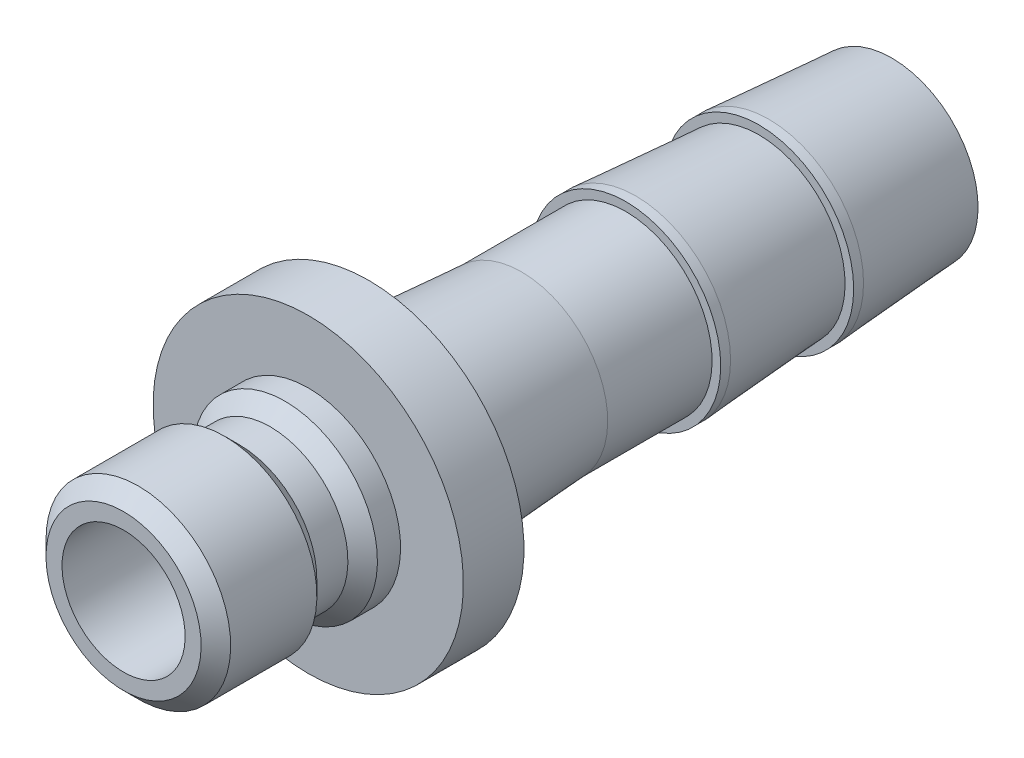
ISO-10303-21;
HEADER;
FILE_DESCRIPTION(('STEP AP214'),'2;1');
FILE_NAME('part.step','',(''),(''),'','','');
FILE_SCHEMA(('AUTOMOTIVE_DESIGN { 1 0 10303 214 1 1 1 1 }'));
ENDSEC;
DATA;
#1=APPLICATION_CONTEXT('core data for automotive mechanical design processes');
#2=APPLICATION_PROTOCOL_DEFINITION('international standard','automotive_design',2000,#1);
#3=PRODUCT_CONTEXT('',#1,'mechanical');
#4=PRODUCT('Part','Part','',(#3));
#5=PRODUCT_RELATED_PRODUCT_CATEGORY('part','',(#4));
#6=PRODUCT_DEFINITION_FORMATION('','',#4);
#7=PRODUCT_DEFINITION_CONTEXT('part definition',#1,'design');
#8=PRODUCT_DEFINITION('design','',#6,#7);
#9=PRODUCT_DEFINITION_SHAPE('','',#8);
#10=(LENGTH_UNIT() NAMED_UNIT(*) SI_UNIT(.MILLI.,.METRE.));
#11=(NAMED_UNIT(*) PLANE_ANGLE_UNIT() SI_UNIT($,.RADIAN.));
#12=(NAMED_UNIT(*) SI_UNIT($,.STERADIAN.) SOLID_ANGLE_UNIT());
#13=UNCERTAINTY_MEASURE_WITH_UNIT(LENGTH_MEASURE(1.E-05),#10,'distance_accuracy_value','');
#14=(GEOMETRIC_REPRESENTATION_CONTEXT(3) GLOBAL_UNCERTAINTY_ASSIGNED_CONTEXT((#13)) GLOBAL_UNIT_ASSIGNED_CONTEXT((#10,
#11,#12)) REPRESENTATION_CONTEXT('',''));
#15=CARTESIAN_POINT('',(0.,0.,0.));
#16=DIRECTION('',(0.,0.,1.));
#17=DIRECTION('',(1.,0.,0.));
#18=AXIS2_PLACEMENT_3D('',#15,#16,#17);
#19=CARTESIAN_POINT('',(0.,0.,0.));
#20=DIRECTION('',(0.,0.,-1.));
#21=DIRECTION('',(0.,1.,0.));
#22=AXIS2_PLACEMENT_3D('',#19,#20,#21);
#23=CYLINDRICAL_SURFACE('',#22,3.175);
#24=CARTESIAN_POINT('',(0.,0.,-30.099));
#25=DIRECTION('',(0.,0.,-1.));
#26=DIRECTION('',(0.,1.,0.));
#27=AXIS2_PLACEMENT_3D('',#24,#25,#26);
#28=CIRCLE('',#27,3.17499999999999);
#29=CARTESIAN_POINT('',(0.,3.175,-30.099));
#30=VERTEX_POINT('',#29);
#31=EDGE_CURVE('E98',#30,#30,#28,.T.);
#32=ORIENTED_EDGE('',*,*,#31,.T.);
#33=EDGE_LOOP('',(#32));
#34=FACE_BOUND('',#33,.T.);
#35=CARTESIAN_POINT('',(0.,0.,9.525));
#36=DIRECTION('',(0.,0.,-1.));
#37=DIRECTION('',(0.,1.,0.));
#38=AXIS2_PLACEMENT_3D('',#35,#36,#37);
#39=CIRCLE('',#38,3.175);
#40=CARTESIAN_POINT('',(0.,3.175,9.525));
#41=VERTEX_POINT('',#40);
#42=EDGE_CURVE('E10',#41,#41,#39,.T.);
#43=ORIENTED_EDGE('',*,*,#42,.F.);
#44=EDGE_LOOP('',(#43));
#45=FACE_BOUND('',#44,.T.);
#46=ADVANCED_FACE('F31',(#34,#45),#23,.F.);
#47=CARTESIAN_POINT('',(0.,3.175,9.525));
#48=DIRECTION('',(0.,0.,1.));
#49=DIRECTION('',(0.,-1.,0.));
#50=AXIS2_PLACEMENT_3D('',#47,#48,#49);
#51=PLANE('',#50);
#52=ORIENTED_EDGE('',*,*,#42,.T.);
#53=EDGE_LOOP('',(#52));
#54=FACE_BOUND('',#53,.T.);
#55=CARTESIAN_POINT('',(0.,0.,9.525));
#56=DIRECTION('',(0.,0.,-1.));
#57=DIRECTION('',(0.,1.,0.));
#58=AXIS2_PLACEMENT_3D('',#55,#56,#57);
#59=CIRCLE('',#58,4.0005);
#60=CARTESIAN_POINT('',(0.,4.0005,9.525));
#61=VERTEX_POINT('',#60);
#62=EDGE_CURVE('E37',#61,#61,#59,.T.);
#63=ORIENTED_EDGE('',*,*,#62,.F.);
#64=EDGE_LOOP('',(#63));
#65=FACE_BOUND('',#64,.T.);
#66=ADVANCED_FACE('F116',(#54,#65),#51,.T.);
#67=CARTESIAN_POINT('',(0.,0.,8.763));
#68=DIRECTION('',(0.,0.,-1.));
#69=DIRECTION('',(0.,1.,0.));
#70=AXIS2_PLACEMENT_3D('',#67,#68,#69);
#71=CONICAL_SURFACE('',#70,4.7625,0.785398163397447);
#72=ORIENTED_EDGE('',*,*,#62,.T.);
#73=EDGE_LOOP('',(#72));
#74=FACE_BOUND('',#73,.T.);
#75=CARTESIAN_POINT('',(0.,0.,8.763));
#76=DIRECTION('',(0.,0.,-1.));
#77=DIRECTION('',(0.,1.,0.));
#78=AXIS2_PLACEMENT_3D('',#75,#76,#77);
#79=CIRCLE('',#78,4.7625);
#80=CARTESIAN_POINT('',(0.,4.7625,8.763));
#81=VERTEX_POINT('',#80);
#82=EDGE_CURVE('E41',#81,#81,#79,.T.);
#83=ORIENTED_EDGE('',*,*,#82,.F.);
#84=EDGE_LOOP('',(#83));
#85=FACE_BOUND('',#84,.T.);
#86=ADVANCED_FACE('F120',(#74,#85),#71,.T.);
#87=CARTESIAN_POINT('',(0.,0.,0.));
#88=DIRECTION('',(0.,0.,-1.));
#89=DIRECTION('',(0.,1.,0.));
#90=AXIS2_PLACEMENT_3D('',#87,#88,#89);
#91=CYLINDRICAL_SURFACE('',#90,4.7625);
#92=ORIENTED_EDGE('',*,*,#82,.T.);
#93=EDGE_LOOP('',(#92));
#94=FACE_BOUND('',#93,.T.);
#95=CARTESIAN_POINT('',(0.,0.,4.318));
#96=DIRECTION('',(0.,0.,-1.));
#97=DIRECTION('',(0.,1.,0.));
#98=AXIS2_PLACEMENT_3D('',#95,#96,#97);
#99=CIRCLE('',#98,4.7625);
#100=CARTESIAN_POINT('',(0.,4.7625,4.318));
#101=VERTEX_POINT('',#100);
#102=EDGE_CURVE('E45',#101,#101,#99,.T.);
#103=ORIENTED_EDGE('',*,*,#102,.F.);
#104=EDGE_LOOP('',(#103));
#105=FACE_BOUND('',#104,.T.);
#106=ADVANCED_FACE('F124',(#94,#105),#91,.T.);
#107=CARTESIAN_POINT('',(0.,0.,3.556));
#108=DIRECTION('',(0.,0.,1.));
#109=DIRECTION('',(0.,-1.,0.));
#110=AXIS2_PLACEMENT_3D('',#107,#108,#109);
#111=CONICAL_SURFACE('',#110,4.0005,0.785398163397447);
#112=ORIENTED_EDGE('',*,*,#102,.T.);
#113=EDGE_LOOP('',(#112));
#114=FACE_BOUND('',#113,.T.);
#115=CARTESIAN_POINT('',(0.,0.,3.556));
#116=DIRECTION('',(0.,0.,-1.));
#117=DIRECTION('',(0.,1.,0.));
#118=AXIS2_PLACEMENT_3D('',#115,#116,#117);
#119=CIRCLE('',#118,4.0005);
#120=CARTESIAN_POINT('',(0.,4.0005,3.556));
#121=VERTEX_POINT('',#120);
#122=EDGE_CURVE('E50',#121,#121,#119,.T.);
#123=ORIENTED_EDGE('',*,*,#122,.F.);
#124=EDGE_LOOP('',(#123));
#125=FACE_BOUND('',#124,.T.);
#126=ADVANCED_FACE('F130',(#114,#125),#111,.T.);
#127=CARTESIAN_POINT('',(0.,0.,0.));
#128=DIRECTION('',(0.,0.,-1.));
#129=DIRECTION('',(0.,1.,0.));
#130=AXIS2_PLACEMENT_3D('',#127,#128,#129);
#131=CYLINDRICAL_SURFACE('',#130,4.0005);
#132=ORIENTED_EDGE('',*,*,#122,.T.);
#133=EDGE_LOOP('',(#132));
#134=FACE_BOUND('',#133,.T.);
#135=CARTESIAN_POINT('',(0.,0.,1.9558));
#136=DIRECTION('',(0.,0.,-1.));
#137=DIRECTION('',(0.,1.,0.));
#138=AXIS2_PLACEMENT_3D('',#135,#136,#137);
#139=CIRCLE('',#138,4.0005);
#140=CARTESIAN_POINT('',(0.,4.0005,1.9558));
#141=VERTEX_POINT('',#140);
#142=EDGE_CURVE('E53',#141,#141,#139,.T.);
#143=ORIENTED_EDGE('',*,*,#142,.F.);
#144=EDGE_LOOP('',(#143));
#145=FACE_BOUND('',#144,.T.);
#146=ADVANCED_FACE('F134',(#134,#145),#131,.T.);
#147=CARTESIAN_POINT('',(0.,0.,1.1938));
#148=DIRECTION('',(0.,0.,-1.));
#149=DIRECTION('',(0.,1.,0.));
#150=AXIS2_PLACEMENT_3D('',#147,#148,#149);
#151=CONICAL_SURFACE('',#150,4.7625,0.785398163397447);
#152=ORIENTED_EDGE('',*,*,#142,.T.);
#153=EDGE_LOOP('',(#152));
#154=FACE_BOUND('',#153,.T.);
#155=CARTESIAN_POINT('',(0.,0.,1.1938));
#156=DIRECTION('',(0.,0.,-1.));
#157=DIRECTION('',(0.,1.,0.));
#158=AXIS2_PLACEMENT_3D('',#155,#156,#157);
#159=CIRCLE('',#158,4.7625);
#160=CARTESIAN_POINT('',(0.,4.7625,1.1938));
#161=VERTEX_POINT('',#160);
#162=EDGE_CURVE('E56',#161,#161,#159,.T.);
#163=ORIENTED_EDGE('',*,*,#162,.F.);
#164=EDGE_LOOP('',(#163));
#165=FACE_BOUND('',#164,.T.);
#166=ADVANCED_FACE('F138',(#154,#165),#151,.T.);
#167=CARTESIAN_POINT('',(0.,0.,0.));
#168=DIRECTION('',(0.,0.,-1.));
#169=DIRECTION('',(0.,1.,0.));
#170=AXIS2_PLACEMENT_3D('',#167,#168,#169);
#171=CYLINDRICAL_SURFACE('',#170,4.7625);
#172=ORIENTED_EDGE('',*,*,#162,.T.);
#173=EDGE_LOOP('',(#172));
#174=FACE_BOUND('',#173,.T.);
#175=CARTESIAN_POINT('',(0.,0.,0.));
#176=DIRECTION('',(0.,0.,-1.));
#177=DIRECTION('',(0.,1.,0.));
#178=AXIS2_PLACEMENT_3D('',#175,#176,#177);
#179=CIRCLE('',#178,4.7625);
#180=CARTESIAN_POINT('',(0.,4.7625,0.));
#181=VERTEX_POINT('',#180);
#182=EDGE_CURVE('E59',#181,#181,#179,.T.);
#183=ORIENTED_EDGE('',*,*,#182,.F.);
#184=EDGE_LOOP('',(#183));
#185=FACE_BOUND('',#184,.T.);
#186=ADVANCED_FACE('F142',(#174,#185),#171,.T.);
#187=CARTESIAN_POINT('',(0.,4.7625,0.));
#188=DIRECTION('',(0.,0.,1.));
#189=DIRECTION('',(0.,-1.,0.));
#190=AXIS2_PLACEMENT_3D('',#187,#188,#189);
#191=PLANE('',#190);
#192=ORIENTED_EDGE('',*,*,#182,.T.);
#193=EDGE_LOOP('',(#192));
#194=FACE_BOUND('',#193,.T.);
#195=CARTESIAN_POINT('',(0.,0.,0.));
#196=DIRECTION('',(0.,0.,-1.));
#197=DIRECTION('',(0.,1.,0.));
#198=AXIS2_PLACEMENT_3D('',#195,#196,#197);
#199=CIRCLE('',#198,8.001);
#200=CARTESIAN_POINT('',(0.,8.001,0.));
#201=VERTEX_POINT('',#200);
#202=EDGE_CURVE('E62',#201,#201,#199,.T.);
#203=ORIENTED_EDGE('',*,*,#202,.F.);
#204=EDGE_LOOP('',(#203));
#205=FACE_BOUND('',#204,.T.);
#206=ADVANCED_FACE('F146',(#194,#205),#191,.T.);
#207=CARTESIAN_POINT('',(0.,0.,0.));
#208=DIRECTION('',(0.,0.,-1.));
#209=DIRECTION('',(0.,1.,0.));
#210=AXIS2_PLACEMENT_3D('',#207,#208,#209);
#211=CYLINDRICAL_SURFACE('',#210,8.001);
#212=ORIENTED_EDGE('',*,*,#202,.T.);
#213=EDGE_LOOP('',(#212));
#214=FACE_BOUND('',#213,.T.);
#215=CARTESIAN_POINT('',(0.,0.,-3.1242));
#216=DIRECTION('',(0.,0.,-1.));
#217=DIRECTION('',(0.,1.,0.));
#218=AXIS2_PLACEMENT_3D('',#215,#216,#217);
#219=CIRCLE('',#218,8.001);
#220=CARTESIAN_POINT('',(0.,8.001,-3.1242));
#221=VERTEX_POINT('',#220);
#222=EDGE_CURVE('E65',#221,#221,#219,.T.);
#223=ORIENTED_EDGE('',*,*,#222,.F.);
#224=EDGE_LOOP('',(#223));
#225=FACE_BOUND('',#224,.T.);
#226=ADVANCED_FACE('F150',(#214,#225),#211,.T.);
#227=CARTESIAN_POINT('',(0.,8.001,-3.1242));
#228=DIRECTION('',(0.,0.,-1.));
#229=DIRECTION('',(0.,1.,0.));
#230=AXIS2_PLACEMENT_3D('',#227,#228,#229);
#231=PLANE('',#230);
#232=ORIENTED_EDGE('',*,*,#222,.T.);
#233=EDGE_LOOP('',(#232));
#234=FACE_BOUND('',#233,.T.);
#235=CARTESIAN_POINT('',(0.,0.,-3.1242));
#236=DIRECTION('',(0.,0.,-1.));
#237=DIRECTION('',(0.,1.,0.));
#238=AXIS2_PLACEMENT_3D('',#235,#236,#237);
#239=CIRCLE('',#238,4.8895);
#240=CARTESIAN_POINT('',(0.,4.8895,-3.1242));
#241=VERTEX_POINT('',#240);
#242=EDGE_CURVE('E68',#241,#241,#239,.T.);
#243=ORIENTED_EDGE('',*,*,#242,.F.);
#244=EDGE_LOOP('',(#243));
#245=FACE_BOUND('',#244,.T.);
#246=ADVANCED_FACE('F154',(#234,#245),#231,.T.);
#247=CARTESIAN_POINT('',(0.,0.,0.));
#248=DIRECTION('',(0.,0.,-1.));
#249=DIRECTION('',(0.,1.,0.));
#250=AXIS2_PLACEMENT_3D('',#247,#248,#249);
#251=CYLINDRICAL_SURFACE('',#250,4.8895);
#252=ORIENTED_EDGE('',*,*,#242,.T.);
#253=EDGE_LOOP('',(#252));
#254=FACE_BOUND('',#253,.T.);
#255=CARTESIAN_POINT('',(0.,0.,-4.6482));
#256=DIRECTION('',(0.,0.,-1.));
#257=DIRECTION('',(0.,1.,0.));
#258=AXIS2_PLACEMENT_3D('',#255,#256,#257);
#259=CIRCLE('',#258,4.8895);
#260=CARTESIAN_POINT('',(0.,4.8895,-4.6482));
#261=VERTEX_POINT('',#260);
#262=EDGE_CURVE('E71',#261,#261,#259,.T.);
#263=ORIENTED_EDGE('',*,*,#262,.F.);
#264=EDGE_LOOP('',(#263));
#265=FACE_BOUND('',#264,.T.);
#266=ADVANCED_FACE('F158',(#254,#265),#251,.T.);
#267=CARTESIAN_POINT('',(0.,0.,-10.9982));
#268=DIRECTION('',(0.,0.,1.));
#269=DIRECTION('',(0.,-1.,0.));
#270=AXIS2_PLACEMENT_3D('',#267,#268,#269);
#271=CONICAL_SURFACE('',#270,4.445,0.0698860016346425);
#272=ORIENTED_EDGE('',*,*,#262,.T.);
#273=EDGE_LOOP('',(#272));
#274=FACE_BOUND('',#273,.T.);
#275=CARTESIAN_POINT('',(0.,0.,-10.9982));
#276=DIRECTION('',(0.,0.,-1.));
#277=DIRECTION('',(0.,1.,0.));
#278=AXIS2_PLACEMENT_3D('',#275,#276,#277);
#279=CIRCLE('',#278,4.445);
#280=CARTESIAN_POINT('',(0.,4.445,-10.9982));
#281=VERTEX_POINT('',#280);
#282=EDGE_CURVE('E74',#281,#281,#279,.T.);
#283=ORIENTED_EDGE('',*,*,#282,.F.);
#284=EDGE_LOOP('',(#283));
#285=FACE_BOUND('',#284,.T.);
#286=ADVANCED_FACE('F162',(#274,#285),#271,.T.);
#287=CARTESIAN_POINT('',(0.,0.,0.));
#288=DIRECTION('',(0.,0.,-1.));
#289=DIRECTION('',(0.,1.,0.));
#290=AXIS2_PLACEMENT_3D('',#287,#288,#289);
#291=CYLINDRICAL_SURFACE('',#290,4.445);
#292=ORIENTED_EDGE('',*,*,#282,.T.);
#293=EDGE_LOOP('',(#292));
#294=FACE_BOUND('',#293,.T.);
#295=CARTESIAN_POINT('',(0.,0.,-16.383));
#296=DIRECTION('',(0.,0.,-1.));
#297=DIRECTION('',(0.,1.,0.));
#298=AXIS2_PLACEMENT_3D('',#295,#296,#297);
#299=CIRCLE('',#298,4.44499999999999);
#300=CARTESIAN_POINT('',(0.,4.445,-16.383));
#301=VERTEX_POINT('',#300);
#302=EDGE_CURVE('E77',#301,#301,#299,.T.);
#303=ORIENTED_EDGE('',*,*,#302,.F.);
#304=EDGE_LOOP('',(#303));
#305=FACE_BOUND('',#304,.T.);
#306=ADVANCED_FACE('F166',(#294,#305),#291,.T.);
#307=CARTESIAN_POINT('',(0.,4.8895,-16.383));
#308=DIRECTION('',(0.,0.,1.));
#309=DIRECTION('',(0.,-1.,0.));
#310=AXIS2_PLACEMENT_3D('',#307,#308,#309);
#311=PLANE('',#310);
#312=ORIENTED_EDGE('',*,*,#302,.T.);
#313=EDGE_LOOP('',(#312));
#314=FACE_BOUND('',#313,.T.);
#315=CARTESIAN_POINT('',(0.,0.,-16.383));
#316=DIRECTION('',(0.,0.,-1.));
#317=DIRECTION('',(0.,1.,0.));
#318=AXIS2_PLACEMENT_3D('',#315,#316,#317);
#319=CIRCLE('',#318,4.8895);
#320=CARTESIAN_POINT('',(0.,4.8895,-16.383));
#321=VERTEX_POINT('',#320);
#322=EDGE_CURVE('E80',#321,#321,#319,.T.);
#323=ORIENTED_EDGE('',*,*,#322,.F.);
#324=EDGE_LOOP('',(#323));
#325=FACE_BOUND('',#324,.T.);
#326=ADVANCED_FACE('F170',(#314,#325),#311,.T.);
#327=CARTESIAN_POINT('',(0.,0.,0.));
#328=DIRECTION('',(0.,0.,-1.));
#329=DIRECTION('',(0.,1.,0.));
#330=AXIS2_PLACEMENT_3D('',#327,#328,#329);
#331=CYLINDRICAL_SURFACE('',#330,4.8895);
#332=ORIENTED_EDGE('',*,*,#322,.T.);
#333=EDGE_LOOP('',(#332));
#334=FACE_BOUND('',#333,.T.);
#335=CARTESIAN_POINT('',(0.,0.,-16.891));
#336=DIRECTION('',(0.,0.,-1.));
#337=DIRECTION('',(0.,1.,0.));
#338=AXIS2_PLACEMENT_3D('',#335,#336,#337);
#339=CIRCLE('',#338,4.8895);
#340=CARTESIAN_POINT('',(0.,4.8895,-16.891));
#341=VERTEX_POINT('',#340);
#342=EDGE_CURVE('E83',#341,#341,#339,.T.);
#343=ORIENTED_EDGE('',*,*,#342,.F.);
#344=EDGE_LOOP('',(#343));
#345=FACE_BOUND('',#344,.T.);
#346=ADVANCED_FACE('F174',(#334,#345),#331,.T.);
#347=CARTESIAN_POINT('',(0.,0.,-23.241));
#348=DIRECTION('',(0.,0.,1.));
#349=DIRECTION('',(0.,-1.,0.));
#350=AXIS2_PLACEMENT_3D('',#347,#348,#349);
#351=CONICAL_SURFACE('',#350,4.445,0.0698860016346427);
#352=ORIENTED_EDGE('',*,*,#342,.T.);
#353=EDGE_LOOP('',(#352));
#354=FACE_BOUND('',#353,.T.);
#355=CARTESIAN_POINT('',(0.,0.,-23.241));
#356=DIRECTION('',(0.,0.,-1.));
#357=DIRECTION('',(0.,1.,0.));
#358=AXIS2_PLACEMENT_3D('',#355,#356,#357);
#359=CIRCLE('',#358,4.445);
#360=CARTESIAN_POINT('',(0.,4.445,-23.241));
#361=VERTEX_POINT('',#360);
#362=EDGE_CURVE('E86',#361,#361,#359,.T.);
#363=ORIENTED_EDGE('',*,*,#362,.F.);
#364=EDGE_LOOP('',(#363));
#365=FACE_BOUND('',#364,.T.);
#366=ADVANCED_FACE('F178',(#354,#365),#351,.T.);
#367=CARTESIAN_POINT('',(0.,4.8895,-23.241));
#368=DIRECTION('',(0.,0.,1.));
#369=DIRECTION('',(0.,-1.,0.));
#370=AXIS2_PLACEMENT_3D('',#367,#368,#369);
#371=PLANE('',#370);
#372=ORIENTED_EDGE('',*,*,#362,.T.);
#373=EDGE_LOOP('',(#372));
#374=FACE_BOUND('',#373,.T.);
#375=CARTESIAN_POINT('',(0.,0.,-23.241));
#376=DIRECTION('',(0.,0.,-1.));
#377=DIRECTION('',(0.,1.,0.));
#378=AXIS2_PLACEMENT_3D('',#375,#376,#377);
#379=CIRCLE('',#378,4.8895);
#380=CARTESIAN_POINT('',(0.,4.8895,-23.241));
#381=VERTEX_POINT('',#380);
#382=EDGE_CURVE('E89',#381,#381,#379,.T.);
#383=ORIENTED_EDGE('',*,*,#382,.F.);
#384=EDGE_LOOP('',(#383));
#385=FACE_BOUND('',#384,.T.);
#386=ADVANCED_FACE('F182',(#374,#385),#371,.T.);
#387=CARTESIAN_POINT('',(0.,0.,0.));
#388=DIRECTION('',(0.,0.,-1.));
#389=DIRECTION('',(0.,1.,0.));
#390=AXIS2_PLACEMENT_3D('',#387,#388,#389);
#391=CYLINDRICAL_SURFACE('',#390,4.8895);
#392=ORIENTED_EDGE('',*,*,#382,.T.);
#393=EDGE_LOOP('',(#392));
#394=FACE_BOUND('',#393,.T.);
#395=CARTESIAN_POINT('',(0.,0.,-23.749));
#396=DIRECTION('',(0.,0.,-1.));
#397=DIRECTION('',(0.,1.,0.));
#398=AXIS2_PLACEMENT_3D('',#395,#396,#397);
#399=CIRCLE('',#398,4.8895);
#400=CARTESIAN_POINT('',(0.,4.8895,-23.749));
#401=VERTEX_POINT('',#400);
#402=EDGE_CURVE('E92',#401,#401,#399,.T.);
#403=ORIENTED_EDGE('',*,*,#402,.F.);
#404=EDGE_LOOP('',(#403));
#405=FACE_BOUND('',#404,.T.);
#406=ADVANCED_FACE('F112',(#394,#405),#391,.T.);
#407=CARTESIAN_POINT('',(0.,0.,-30.099));
#408=DIRECTION('',(0.,0.,1.));
#409=DIRECTION('',(0.,-1.,0.));
#410=AXIS2_PLACEMENT_3D('',#407,#408,#409);
#411=CONICAL_SURFACE('',#410,4.44499999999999,0.0698860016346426);
#412=ORIENTED_EDGE('',*,*,#402,.T.);
#413=EDGE_LOOP('',(#412));
#414=FACE_BOUND('',#413,.T.);
#415=CARTESIAN_POINT('',(0.,0.,-30.099));
#416=DIRECTION('',(0.,0.,-1.));
#417=DIRECTION('',(0.,1.,0.));
#418=AXIS2_PLACEMENT_3D('',#415,#416,#417);
#419=CIRCLE('',#418,4.44499999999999);
#420=CARTESIAN_POINT('',(0.,4.445,-30.099));
#421=VERTEX_POINT('',#420);
#422=EDGE_CURVE('E95',#421,#421,#419,.T.);
#423=ORIENTED_EDGE('',*,*,#422,.F.);
#424=EDGE_LOOP('',(#423));
#425=FACE_BOUND('',#424,.T.);
#426=ADVANCED_FACE('F106',(#414,#425),#411,.T.);
#427=CARTESIAN_POINT('',(0.,4.445,-30.099));
#428=DIRECTION('',(0.,0.,-1.));
#429=DIRECTION('',(0.,1.,0.));
#430=AXIS2_PLACEMENT_3D('',#427,#428,#429);
#431=PLANE('',#430);
#432=ORIENTED_EDGE('',*,*,#422,.T.);
#433=EDGE_LOOP('',(#432));
#434=FACE_BOUND('',#433,.T.);
#435=ORIENTED_EDGE('',*,*,#31,.F.);
#436=EDGE_LOOP('',(#435));
#437=FACE_BOUND('',#436,.T.);
#438=ADVANCED_FACE('F104',(#434,#437),#431,.T.);
#439=CLOSED_SHELL('',(#46,#66,#86,#106,#126,#146,#166,#186,#206,#226,#246,#266,#286,#306,#326,
#346,#366,#386,#406,#426,#438));
#440=MANIFOLD_SOLID_BREP('B2',#439);
#441=ADVANCED_BREP_SHAPE_REPRESENTATION('',(#18,#440),#14);
#442=SHAPE_DEFINITION_REPRESENTATION(#9,#441);
ENDSEC;
END-ISO-10303-21;
